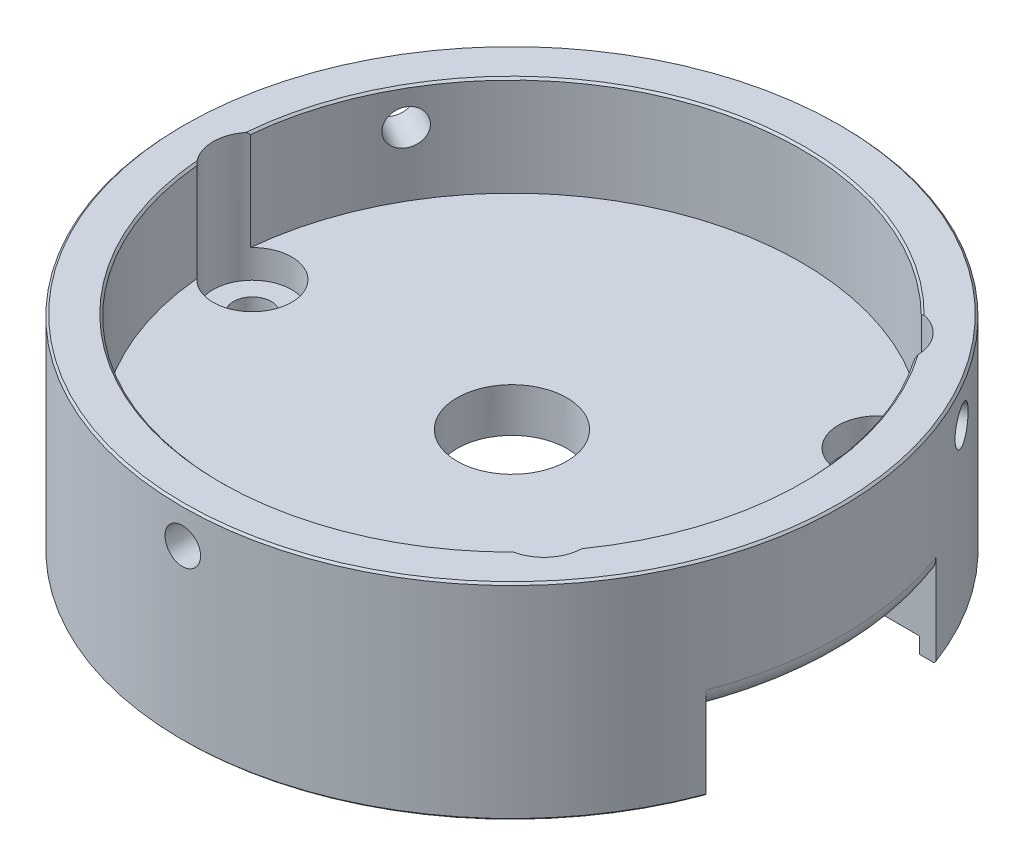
from build123d import *

# Parameters (mm, degrees)
SKETCH1_R                                = 20.955
EXTRUDE1_DEPTH                           = 17.78
SKETCH2_OUTSIDE_W                        = 56.286
SKETCH2_OUTSIDE_H                        = 56.286
SKETCH2_OUTSIDE_R                        = 17.272
OUTSIDE_LOWER_RELIEF_DEPTH               = 4.699
SKETCH3_R                                = 18.4023
RESOLVER_BORE_DEPTH                      = 6.35
SKETCH4_R                                = 3.4925
SHAFT_HOLE_DEPTH                         = 32.762697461
SKETCH5_R                                = 15.875
INSIDE_LOWER_RELIEF_DEPTH                = 6.858
WIRE_RELIEF_DEPTH                        = 9.271
COUNTER_BORE_FOR_MOTOR_SCREWS_AT_2_COUNT = 2
COUNTER_BORE_FOR_MOTOR_SCREWS_AT_2_PITCH = 21.21199112
COUNTER_BORE_FOR_MOTOR_SCREWS_AT_3_COUNT = 2
COUNTER_BORE_FOR_MOTOR_SCREWS_AT_3_PITCH = 31.009856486
F_05_CHAMFER_SIZE                        = 0.127
FILLET_FOR_WIRE_RELIEF_R                 = 1.27
CIRPATTERN1_COUNT                        = 3
CUT_EXTRUDE1_REACH                       = 36.559
SKETCH13_R                               = 2.5
SKETCH14_R                               = 19.9771
CUT_EXTRUDE2_DEPTH                       = 5.715
SKETCH15_R                               = 11.43
CUT_EXTRUDE3_DEPTH                       = 1.778


with BuildPart() as part:
    # Sketch1 → Extrude1 (new body)
    with BuildSketch(Plane(origin=(0, 0, 0), x_dir=(1, 0, 0), z_dir=(0, 1, 0))):
        with Locations(Location((0, 0, 0), (0, 0, 270))):
            Circle(SKETCH1_R)
    extrude(amount=EXTRUDE1_DEPTH)

    # Sketch2 outside → Outside Lower Relief (cut)
    with BuildSketch(Plane.XZ):
        Rectangle(SKETCH2_OUTSIDE_W, SKETCH2_OUTSIDE_H)
        with Locations(Location((0, 0, 0), (0, 0, 270))):
            Circle(SKETCH2_OUTSIDE_R, mode=Mode.SUBTRACT)
    extrude(amount=-OUTSIDE_LOWER_RELIEF_DEPTH, mode=Mode.SUBTRACT)

    # Sketch3 → Resolver Bore (cut)
    with BuildSketch(Plane(origin=(0, 17.78, 0), x_dir=(-1, 0, 0), z_dir=(0, 1, 0))):
        with Locations(Location((0, 0, 0), (0, 0, 90))):
            Circle(SKETCH3_R)
    extrude(amount=-RESOLVER_BORE_DEPTH, mode=Mode.SUBTRACT)

    # Sketch4 → Shaft Hole (cut, through all)
    with BuildSketch(Plane(origin=(0, 11.43, 0), x_dir=(-1, 0, 0), z_dir=(0, 1, 0))):
        with Locations(Location((0, 0, 0), (0, 0, 90))):
            Circle(SKETCH4_R)
    extrude(amount=-SHAFT_HOLE_DEPTH, mode=Mode.SUBTRACT)

    # Sketch5 → Inside lower relief (cut)
    with BuildSketch(Plane.XZ):
        with Locations(Location((0, 0, 0), (0, 0, 270))):
            Circle(SKETCH5_R)
    extrude(amount=-INSIDE_LOWER_RELIEF_DEPTH, mode=Mode.SUBTRACT)

    # Sketch8 → Wire relief (cut)
    with BuildSketch(Plane.XZ):
        with BuildLine():
            Line((19.641423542, 7.3025), (14.396746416, 7.3025))
            ThreePointArc((14.396746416, 7.3025), (7.094246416, 0), (14.396746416, -7.3025))
            Line((14.396746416, -7.3025), (19.641423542, -7.3025))
            ThreePointArc((19.641423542, -7.3025), (20.955, 0), (19.641423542, 7.3025))
        make_face()
    extrude(amount=-WIRE_RELIEF_DEPTH, mode=Mode.SUBTRACT)

    # Sketch9 → Counter bore for motor screws (revolve, cut)
    with BuildSketch(Plane(origin=(12.639733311, 11.43, 10.60599556), x_dir=(0, 0, 1), z_dir=(1, 0, 0))):
        Polygon((0, 0), (0, 11.43), (1.2, 11.43), (1.2, 1.8), (2.5, 1.8), (2.5, 0), align=None)
    counter_bore_for_motor_screws = revolve(axis=Axis((12.639733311, 17.78, 10.60599556), (0, -1, 0)), mode=Mode.SUBTRACT)

    # Counter bore for motor screws at 2: Counter bore for motor screws ×2
    with Locations(*[(0, 0, -i * COUNTER_BORE_FOR_MOTOR_SCREWS_AT_2_PITCH) for i in range(1, COUNTER_BORE_FOR_MOTOR_SCREWS_AT_2_COUNT)]):
        add(counter_bore_for_motor_screws, mode=Mode.SUBTRACT)

    # Counter bore for motor screws at 3: Counter bore for motor screws ×2
    with Locations(*[Vector(-0.9396926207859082, 0, -0.3420201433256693) * (i * COUNTER_BORE_FOR_MOTOR_SCREWS_AT_3_PITCH) for i in range(1, COUNTER_BORE_FOR_MOTOR_SCREWS_AT_3_COUNT)]):
        add(counter_bore_for_motor_screws, mode=Mode.SUBTRACT)

    # 05 chamfer
    f_05_chamfer_edges = [part.edges().sort_by_distance(p)[0] for p in [
        (-5.907371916, 0, 16.230370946),
        (0, 17.78, -18.4023),
        (14.813319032, 0, 8.881867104),
        (0, 17.78, -20.955),
        (-17.206625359, 4.699, -11.960103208),
        (-5.907371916, 0, -16.230370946),
        (14.813319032, 0, -8.881867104),
    ]]
    chamfer(f_05_chamfer_edges, length=F_05_CHAMFER_SIZE)

    # fillet for wire relief
    fillet_for_wire_relief_edges = [part.edges().sort_by_distance(p)[0] for p in [
        (20.955, 9.271, 0),
    ]]
    fillet(fillet_for_wire_relief_edges, radius=FILLET_FOR_WIRE_RELIEF_R)

    # Sketch12 → 4-40 Tapped Hole1 (revolve, cut)
    with BuildSketch(Plane(origin=(0, 15.494, 20.955), x_dir=(0, -1, 0), z_dir=(1, 0, 0))):
        Polygon((0, 0), (0, 8.273752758), (1.1303, 7.5946), (1.1303, 0), align=None)
    f_4_40_tapped_hole1 = revolve(axis=Axis((0, 15.494, 27.305), (0, 0, -1)), mode=Mode.SUBTRACT)

    # CirPattern1: 4-40 Tapped Hole1 ×3 about axis
    cirpattern1_axis = Axis((0, 4.699, 0), (0, -1, 0))
    for i in range(1, CIRPATTERN1_COUNT):
        add(f_4_40_tapped_hole1.rotate(cirpattern1_axis, i * 360 / CIRPATTERN1_COUNT), mode=Mode.SUBTRACT)

    # Sketch13 → Cut-Extrude1 (cut, up to next)
    with BuildSketch(Plane(origin=(0, 17.78, 0), x_dir=(-1, 0, 0), z_dir=(0, 1, 0)), mode=Mode.PRIVATE) as cut_extrude1_sk1:
        with Locations(Location((-12.639733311, -10.60599556, 0), (0, 0, 90))):
            Circle(SKETCH13_R)
    cut_extrude1_tool1 = extrude(cut_extrude1_sk1.sketch, amount=-CUT_EXTRUDE1_REACH, mode=Mode.PRIVATE) & part.part
    # Sketch13 → Cut-Extrude1 (cut, up to next)
    with BuildSketch(Plane(origin=(0, 17.78, 0), x_dir=(-1, 0, 0), z_dir=(0, 1, 0)), mode=Mode.PRIVATE) as cut_extrude1_sk2:
        with Locations(Location((-12.639733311, 10.60599556, 0), (0, 0, 90))):
            Circle(SKETCH13_R)
    cut_extrude1_tool2 = extrude(cut_extrude1_sk2.sketch, amount=-CUT_EXTRUDE1_REACH, mode=Mode.PRIVATE) & part.part
    # Sketch13 → Cut-Extrude1 (cut, up to next)
    with BuildSketch(Plane(origin=(0, 17.78, 0), x_dir=(-1, 0, 0), z_dir=(0, 1, 0)), mode=Mode.PRIVATE) as cut_extrude1_sk3:
        with Locations(Location((16.5, 0, 0), (0, 0, 90))):
            Circle(SKETCH13_R)
    cut_extrude1_tool3 = extrude(cut_extrude1_sk3.sketch, amount=-CUT_EXTRUDE1_REACH, mode=Mode.PRIVATE) & part.part
    add(cut_extrude1_tool1.solids().sort_by_distance((12.639733, 17.78, -10.605996))[0], mode=Mode.SUBTRACT)
    add(cut_extrude1_tool2.solids().sort_by_distance((12.639733, 17.78, 10.605996))[0], mode=Mode.SUBTRACT)
    add(cut_extrude1_tool3.solids().sort_by_distance((-16.5, 17.78, 0))[0], mode=Mode.SUBTRACT)

    # Sketch14 → Cut-Extrude2 (cut)
    with BuildSketch(Plane.XZ):
        Circle(SKETCH14_R)
    extrude(amount=-CUT_EXTRUDE2_DEPTH, mode=Mode.SUBTRACT)

    # Sketch15 → Cut-Extrude3 (cut)
    with BuildSketch(Plane.XZ.offset(-6.858)):
        Circle(SKETCH15_R)
    extrude(amount=-CUT_EXTRUDE3_DEPTH, mode=Mode.SUBTRACT)


solid = part.part
